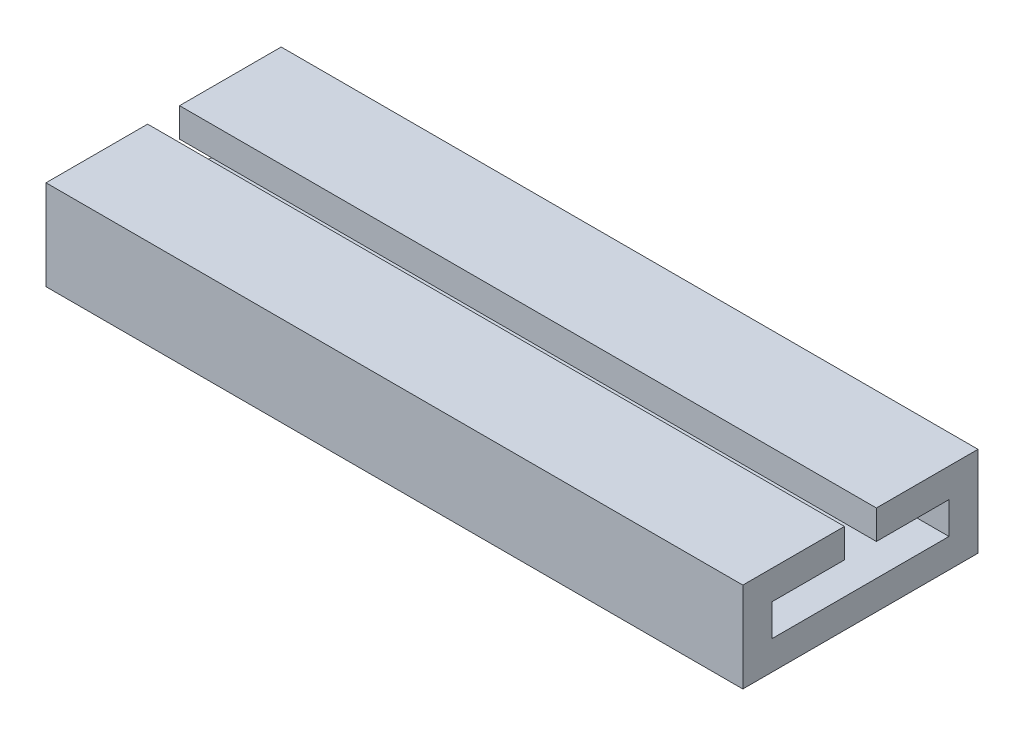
from build123d import *

# Parameters (mm, degrees)
SKETCH1_W           = 40.5
SKETCH1_H           = 15.5
BOSS_EXTRUDE1_DEPTH = 120
SKETCH2_W           = 30.5
SKETCH2_H           = 5.5
CUT_EXTRUDE1_DEPTH  = 122.943121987
SKETCH3_W           = 5.5
SKETCH3_H           = 5
CUT_EXTRUDE2_DEPTH  = 122.943121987
SKETCH4_W           = 100
SKETCH4_H           = 5.5
CUT_EXTRUDE3_DEPTH  = 123.148731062


with BuildPart() as part:
    # Sketch1 → Boss-Extrude1 (new body)
    with BuildSketch(Plane(origin=(0, 0, 0), x_dir=(0, 0, -1), z_dir=(1, 0, 0))):
        Rectangle(SKETCH1_W, SKETCH1_H)
    extrude(amount=BOSS_EXTRUDE1_DEPTH)

    # Sketch2 → Cut-Extrude1 (cut, through all)
    with BuildSketch(Plane(origin=(120, 0, 0), x_dir=(0, 0, -1), z_dir=(1, 0, 0))):
        Rectangle(SKETCH2_W, SKETCH2_H)
    extrude(amount=-CUT_EXTRUDE1_DEPTH, mode=Mode.SUBTRACT)

    # Sketch3 → Cut-Extrude2 (cut, through all)
    with BuildSketch(Plane.ZY):
        with Locations((0, 5.25)):
            Rectangle(SKETCH3_W, SKETCH3_H)
    extrude(amount=-CUT_EXTRUDE2_DEPTH, mode=Mode.SUBTRACT)

    # Sketch4 → Cut-Extrude3 (cut, through all)
    with BuildSketch(Plane(origin=(0, -2.75, 0), x_dir=(1, 0, 0), z_dir=(0, 1, 0))):
        with Locations((60, 0)):
            Rectangle(SKETCH4_W, SKETCH4_H)
    extrude(amount=-CUT_EXTRUDE3_DEPTH, mode=Mode.SUBTRACT)


solid = part.part
